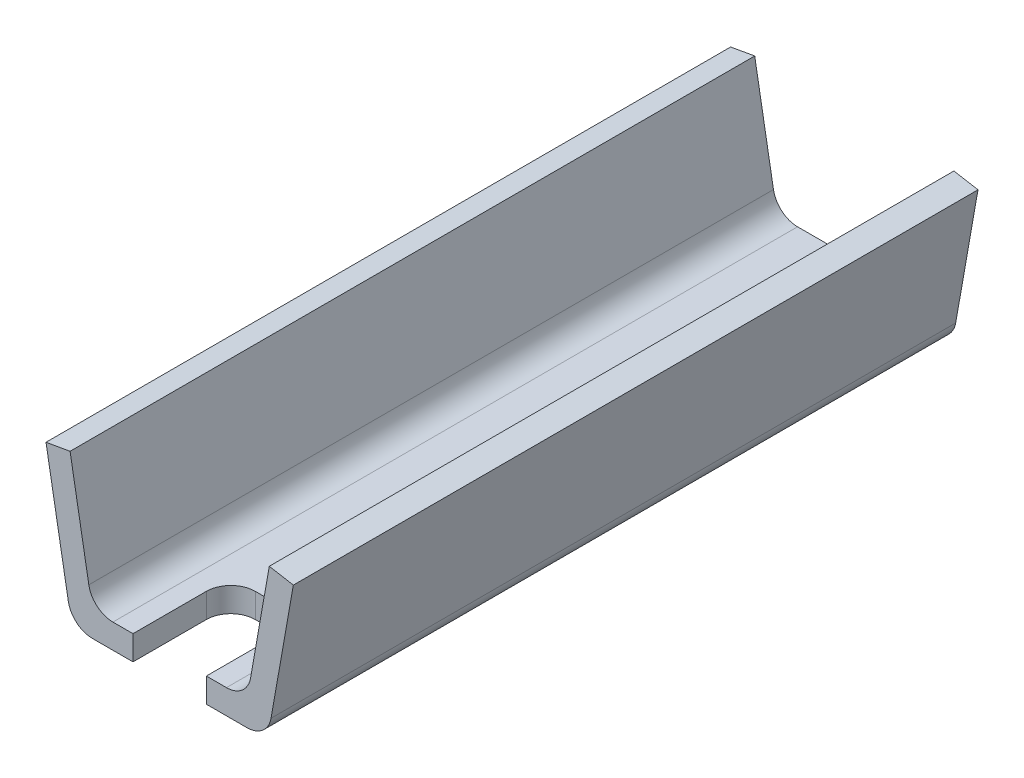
ISO-10303-21;
HEADER;
FILE_DESCRIPTION(('STEP AP214'),'2;1');
FILE_NAME('part.step','',(''),(''),'','','');
FILE_SCHEMA(('AUTOMOTIVE_DESIGN { 1 0 10303 214 1 1 1 1 }'));
ENDSEC;
DATA;
#1=APPLICATION_CONTEXT('core data for automotive mechanical design processes');
#2=APPLICATION_PROTOCOL_DEFINITION('international standard','automotive_design',2000,#1);
#3=PRODUCT_CONTEXT('',#1,'mechanical');
#4=PRODUCT('Part','Part','',(#3));
#5=PRODUCT_RELATED_PRODUCT_CATEGORY('part','',(#4));
#6=PRODUCT_DEFINITION_FORMATION('','',#4);
#7=PRODUCT_DEFINITION_CONTEXT('part definition',#1,'design');
#8=PRODUCT_DEFINITION('design','',#6,#7);
#9=PRODUCT_DEFINITION_SHAPE('','',#8);
#10=(LENGTH_UNIT() NAMED_UNIT(*) SI_UNIT(.MILLI.,.METRE.));
#11=(NAMED_UNIT(*) PLANE_ANGLE_UNIT() SI_UNIT($,.RADIAN.));
#12=(NAMED_UNIT(*) SI_UNIT($,.STERADIAN.) SOLID_ANGLE_UNIT());
#13=UNCERTAINTY_MEASURE_WITH_UNIT(LENGTH_MEASURE(1.E-05),#10,'distance_accuracy_value','');
#14=(GEOMETRIC_REPRESENTATION_CONTEXT(3) GLOBAL_UNCERTAINTY_ASSIGNED_CONTEXT((#13)) GLOBAL_UNIT_ASSIGNED_CONTEXT((#10,
#11,#12)) REPRESENTATION_CONTEXT('',''));
#15=CARTESIAN_POINT('',(0.,0.,0.));
#16=DIRECTION('',(0.,0.,1.));
#17=DIRECTION('',(1.,0.,0.));
#18=AXIS2_PLACEMENT_3D('',#15,#16,#17);
#19=CARTESIAN_POINT('',(11.6090036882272,10.,140.));
#20=DIRECTION('',(0.,0.,-1.));
#21=DIRECTION('',(-1.,0.,0.));
#22=AXIS2_PLACEMENT_3D('',#19,#20,#21);
#23=PLANE('',#22);
#24=DIRECTION('',(1.,0.,0.));
#25=VECTOR('',#24,1.);
#26=CARTESIAN_POINT('',(-15.8045018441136,0.,140.));
#27=LINE('',#26,#25);
#28=CARTESIAN_POINT('',(-15.8045018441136,0.,140.));
#29=VERTEX_POINT('',#28);
#30=CARTESIAN_POINT('',(-7.5,0.,140.));
#31=VERTEX_POINT('',#30);
#32=EDGE_CURVE('E207',#29,#31,#27,.T.);
#33=ORIENTED_EDGE('',*,*,#32,.T.);
#34=DIRECTION('',(0.,1.,0.));
#35=VECTOR('',#34,1.);
#36=CARTESIAN_POINT('',(-7.5,9.99999999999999,140.));
#37=LINE('',#36,#35);
#38=CARTESIAN_POINT('',(-7.5,5.,140.));
#39=VERTEX_POINT('',#38);
#40=EDGE_CURVE('E184',#31,#39,#37,.T.);
#41=ORIENTED_EDGE('',*,*,#40,.T.);
#42=DIRECTION('',(-1.,0.,0.));
#43=VECTOR('',#42,1.);
#44=CARTESIAN_POINT('',(11.6090036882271,5.,140.));
#45=LINE('',#44,#43);
#46=CARTESIAN_POINT('',(-11.6090036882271,5.,140.));
#47=VERTEX_POINT('',#46);
#48=EDGE_CURVE('E192',#39,#47,#45,.T.);
#49=ORIENTED_EDGE('',*,*,#48,.T.);
#50=CARTESIAN_POINT('',(-11.6090036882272,9.99999999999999,140.));
#51=DIRECTION('',(0.,0.,-1.));
#52=DIRECTION('',(-1.,0.,0.));
#53=AXIS2_PLACEMENT_3D('',#50,#51,#52);
#54=CIRCLE('',#53,5.);
#55=CARTESIAN_POINT('',(-16.5330424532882,9.13175911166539,140.));
#56=VERTEX_POINT('',#55);
#57=EDGE_CURVE('E191',#47,#56,#54,.T.);
#58=ORIENTED_EDGE('',*,*,#57,.T.);
#59=DIRECTION('',(-0.173648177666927,0.984807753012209,0.));
#60=VECTOR('',#59,1.);
#61=CARTESIAN_POINT('',(-16.5330424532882,9.13175911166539,140.));
#62=LINE('',#61,#60);
#63=CARTESIAN_POINT('',(-20.3657706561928,30.8682408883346,140.));
#64=VERTEX_POINT('',#63);
#65=EDGE_CURVE('E194',#56,#64,#62,.T.);
#66=ORIENTED_EDGE('',*,*,#65,.T.);
#67=DIRECTION('',(-0.984807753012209,-0.173648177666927,0.));
#68=VECTOR('',#67,1.);
#69=CARTESIAN_POINT('',(-20.3657706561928,30.8682408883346,140.));
#70=LINE('',#69,#68);
#71=CARTESIAN_POINT('',(-25.2898094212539,30.,140.));
#72=VERTEX_POINT('',#71);
#73=EDGE_CURVE('E200',#64,#72,#70,.T.);
#74=ORIENTED_EDGE('',*,*,#73,.T.);
#75=DIRECTION('',(0.173648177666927,-0.984807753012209,0.));
#76=VECTOR('',#75,1.);
#77=CARTESIAN_POINT('',(-25.2898094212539,30.,140.));
#78=LINE('',#77,#76);
#79=CARTESIAN_POINT('',(-20.7285406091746,4.13175911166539,140.));
#80=VERTEX_POINT('',#79);
#81=EDGE_CURVE('E202',#72,#80,#78,.T.);
#82=ORIENTED_EDGE('',*,*,#81,.T.);
#83=CARTESIAN_POINT('',(-15.8045018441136,5.,140.));
#84=DIRECTION('',(0.,0.,1.));
#85=DIRECTION('',(-1.,0.,0.));
#86=AXIS2_PLACEMENT_3D('',#83,#84,#85);
#87=CIRCLE('',#86,5.);
#88=EDGE_CURVE('E204',#80,#29,#87,.T.);
#89=ORIENTED_EDGE('',*,*,#88,.T.);
#90=EDGE_LOOP('',(#33,#41,#49,#58,#66,#74,#82,#89));
#91=FACE_BOUND('',#90,.T.);
#92=ADVANCED_FACE('F41',(#91),#23,.F.);
#93=CARTESIAN_POINT('',(25.2898094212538,30.,140.));
#94=DIRECTION('',(-0.173648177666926,-0.984807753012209,0.));
#95=DIRECTION('',(0.984807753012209,-0.173648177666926,0.));
#96=AXIS2_PLACEMENT_3D('',#93,#94,#95);
#97=PLANE('',#96);
#98=DIRECTION('',(-0.984807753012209,0.173648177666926,0.));
#99=VECTOR('',#98,1.);
#100=CARTESIAN_POINT('',(25.2898094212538,30.,0.));
#101=LINE('',#100,#99);
#102=CARTESIAN_POINT('',(25.2898094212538,30.,0.));
#103=VERTEX_POINT('',#102);
#104=CARTESIAN_POINT('',(20.3657706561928,30.8682408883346,0.));
#105=VERTEX_POINT('',#104);
#106=EDGE_CURVE('E349',#103,#105,#101,.T.);
#107=ORIENTED_EDGE('',*,*,#106,.T.);
#108=DIRECTION('',(0.,0.,-1.));
#109=VECTOR('',#108,1.);
#110=CARTESIAN_POINT('',(20.3657706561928,30.8682408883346,140.));
#111=LINE('',#110,#109);
#112=CARTESIAN_POINT('',(20.3657706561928,30.8682408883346,140.));
#113=VERTEX_POINT('',#112);
#114=EDGE_CURVE('E185',#113,#105,#111,.T.);
#115=ORIENTED_EDGE('',*,*,#114,.F.);
#116=DIRECTION('',(-0.984807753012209,0.173648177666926,0.));
#117=VECTOR('',#116,1.);
#118=CARTESIAN_POINT('',(25.2898094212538,30.,140.));
#119=LINE('',#118,#117);
#120=CARTESIAN_POINT('',(25.2898094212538,30.,140.));
#121=VERTEX_POINT('',#120);
#122=EDGE_CURVE('E374',#121,#113,#119,.T.);
#123=ORIENTED_EDGE('',*,*,#122,.F.);
#124=DIRECTION('',(0.,0.,-1.));
#125=VECTOR('',#124,1.);
#126=CARTESIAN_POINT('',(25.2898094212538,30.,140.));
#127=LINE('',#126,#125);
#128=EDGE_CURVE('E214',#121,#103,#127,.T.);
#129=ORIENTED_EDGE('',*,*,#128,.T.);
#130=EDGE_LOOP('',(#107,#115,#123,#129));
#131=FACE_BOUND('',#130,.T.);
#132=ADVANCED_FACE('F43',(#131),#97,.F.);
#133=CARTESIAN_POINT('',(20.3657706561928,30.8682408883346,140.));
#134=DIRECTION('',(0.984807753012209,-0.173648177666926,0.));
#135=DIRECTION('',(0.173648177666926,0.984807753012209,0.));
#136=AXIS2_PLACEMENT_3D('',#133,#134,#135);
#137=PLANE('',#136);
#138=DIRECTION('',(-0.173648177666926,-0.984807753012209,0.));
#139=VECTOR('',#138,1.);
#140=CARTESIAN_POINT('',(20.3657706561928,30.8682408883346,0.));
#141=LINE('',#140,#139);
#142=CARTESIAN_POINT('',(16.5330424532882,9.1317591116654,0.));
#143=VERTEX_POINT('',#142);
#144=EDGE_CURVE('E343',#105,#143,#141,.T.);
#145=ORIENTED_EDGE('',*,*,#144,.T.);
#146=DIRECTION('',(0.,0.,-1.));
#147=VECTOR('',#146,1.);
#148=CARTESIAN_POINT('',(16.5330424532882,9.1317591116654,140.));
#149=LINE('',#148,#147);
#150=CARTESIAN_POINT('',(16.5330424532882,9.1317591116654,140.));
#151=VERTEX_POINT('',#150);
#152=EDGE_CURVE('E243',#151,#143,#149,.T.);
#153=ORIENTED_EDGE('',*,*,#152,.F.);
#154=DIRECTION('',(-0.173648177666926,-0.984807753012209,0.));
#155=VECTOR('',#154,1.);
#156=CARTESIAN_POINT('',(20.3657706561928,30.8682408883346,140.));
#157=LINE('',#156,#155);
#158=EDGE_CURVE('E376',#113,#151,#157,.T.);
#159=ORIENTED_EDGE('',*,*,#158,.F.);
#160=ORIENTED_EDGE('',*,*,#114,.T.);
#161=EDGE_LOOP('',(#145,#153,#159,#160));
#162=FACE_BOUND('',#161,.T.);
#163=ADVANCED_FACE('F293',(#162),#137,.F.);
#164=CARTESIAN_POINT('',(11.6090036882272,10.,140.));
#165=DIRECTION('',(0.,0.,-1.));
#166=DIRECTION('',(-1.,0.,0.));
#167=AXIS2_PLACEMENT_3D('',#164,#165,#166);
#168=CYLINDRICAL_SURFACE('',#167,5.);
#169=CARTESIAN_POINT('',(11.6090036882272,10.,0.));
#170=DIRECTION('',(0.,0.,-1.));
#171=DIRECTION('',(-1.,0.,0.));
#172=AXIS2_PLACEMENT_3D('',#169,#170,#171);
#173=CIRCLE('',#172,5.);
#174=CARTESIAN_POINT('',(11.6090036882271,5.,0.));
#175=VERTEX_POINT('',#174);
#176=EDGE_CURVE('E348',#143,#175,#173,.T.);
#177=ORIENTED_EDGE('',*,*,#176,.T.);
#178=DIRECTION('',(0.,0.,-1.));
#179=VECTOR('',#178,1.);
#180=CARTESIAN_POINT('',(11.6090036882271,5.,140.));
#181=LINE('',#180,#179);
#182=CARTESIAN_POINT('',(11.6090036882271,5.,140.));
#183=VERTEX_POINT('',#182);
#184=EDGE_CURVE('E241',#183,#175,#181,.T.);
#185=ORIENTED_EDGE('',*,*,#184,.F.);
#186=CARTESIAN_POINT('',(11.6090036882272,10.,140.));
#187=DIRECTION('',(0.,0.,-1.));
#188=DIRECTION('',(-1.,0.,0.));
#189=AXIS2_PLACEMENT_3D('',#186,#187,#188);
#190=CIRCLE('',#189,5.);
#191=EDGE_CURVE('E189',#151,#183,#190,.T.);
#192=ORIENTED_EDGE('',*,*,#191,.F.);
#193=ORIENTED_EDGE('',*,*,#152,.T.);
#194=EDGE_LOOP('',(#177,#185,#192,#193));
#195=FACE_BOUND('',#194,.T.);
#196=ADVANCED_FACE('F335',(#195),#168,.F.);
#197=CARTESIAN_POINT('',(11.6090036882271,5.,140.));
#198=DIRECTION('',(0.,-1.,0.));
#199=DIRECTION('',(1.,0.,0.));
#200=AXIS2_PLACEMENT_3D('',#197,#198,#199);
#201=PLANE('',#200);
#202=ORIENTED_EDGE('',*,*,#48,.F.);
#203=DIRECTION('',(0.,0.,-1.));
#204=VECTOR('',#203,1.);
#205=CARTESIAN_POINT('',(-7.5,5.,140.));
#206=LINE('',#205,#204);
#207=CARTESIAN_POINT('',(-7.5,5.,125.));
#208=VERTEX_POINT('',#207);
#209=EDGE_CURVE('E382',#39,#208,#206,.T.);
#210=ORIENTED_EDGE('',*,*,#209,.T.);
#211=CARTESIAN_POINT('',(-2.5,5.,125.));
#212=DIRECTION('',(0.,-1.,0.));
#213=DIRECTION('',(1.,0.,0.));
#214=AXIS2_PLACEMENT_3D('',#211,#212,#213);
#215=CIRCLE('',#214,5.);
#216=CARTESIAN_POINT('',(-2.5,5.,120.));
#217=VERTEX_POINT('',#216);
#218=EDGE_CURVE('E11',#208,#217,#215,.T.);
#219=ORIENTED_EDGE('',*,*,#218,.T.);
#220=DIRECTION('',(-1.,0.,0.));
#221=VECTOR('',#220,1.);
#222=CARTESIAN_POINT('',(11.6090036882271,5.,120.));
#223=LINE('',#222,#221);
#224=CARTESIAN_POINT('',(2.5,5.,120.));
#225=VERTEX_POINT('',#224);
#226=EDGE_CURVE('E381',#225,#217,#223,.T.);
#227=ORIENTED_EDGE('',*,*,#226,.F.);
#228=CARTESIAN_POINT('',(2.5,5.,125.));
#229=DIRECTION('',(0.,-1.,0.));
#230=DIRECTION('',(1.,0.,0.));
#231=AXIS2_PLACEMENT_3D('',#228,#229,#230);
#232=CIRCLE('',#231,5.);
#233=CARTESIAN_POINT('',(7.5,5.,125.));
#234=VERTEX_POINT('',#233);
#235=EDGE_CURVE('E172',#225,#234,#232,.T.);
#236=ORIENTED_EDGE('',*,*,#235,.T.);
#237=DIRECTION('',(0.,0.,1.));
#238=VECTOR('',#237,1.);
#239=CARTESIAN_POINT('',(7.5,5.,140.));
#240=LINE('',#239,#238);
#241=CARTESIAN_POINT('',(7.5,5.,140.));
#242=VERTEX_POINT('',#241);
#243=EDGE_CURVE('E164',#234,#242,#240,.T.);
#244=ORIENTED_EDGE('',*,*,#243,.T.);
#245=EDGE_CURVE('E170',#183,#242,#45,.T.);
#246=ORIENTED_EDGE('',*,*,#245,.F.);
#247=ORIENTED_EDGE('',*,*,#184,.T.);
#248=DIRECTION('',(-1.,0.,0.));
#249=VECTOR('',#248,1.);
#250=CARTESIAN_POINT('',(11.6090036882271,5.,0.));
#251=LINE('',#250,#249);
#252=CARTESIAN_POINT('',(-11.6090036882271,5.,0.));
#253=VERTEX_POINT('',#252);
#254=EDGE_CURVE('E353',#175,#253,#251,.T.);
#255=ORIENTED_EDGE('',*,*,#254,.T.);
#256=DIRECTION('',(0.,0.,-1.));
#257=VECTOR('',#256,1.);
#258=CARTESIAN_POINT('',(-11.6090036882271,5.,140.));
#259=LINE('',#258,#257);
#260=EDGE_CURVE('E238',#47,#253,#259,.T.);
#261=ORIENTED_EDGE('',*,*,#260,.F.);
#262=EDGE_LOOP('',(#202,#210,#219,#227,#236,#244,#246,#247,#255,#261));
#263=FACE_BOUND('',#262,.T.);
#264=ADVANCED_FACE('F167',(#263),#201,.F.);
#265=CARTESIAN_POINT('',(-11.6090036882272,9.99999999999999,140.));
#266=DIRECTION('',(0.,0.,-1.));
#267=DIRECTION('',(-1.,0.,0.));
#268=AXIS2_PLACEMENT_3D('',#265,#266,#267);
#269=CYLINDRICAL_SURFACE('',#268,5.);
#270=CARTESIAN_POINT('',(-11.6090036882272,9.99999999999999,0.));
#271=DIRECTION('',(0.,0.,-1.));
#272=DIRECTION('',(-1.,0.,0.));
#273=AXIS2_PLACEMENT_3D('',#270,#271,#272);
#274=CIRCLE('',#273,5.);
#275=CARTESIAN_POINT('',(-16.5330424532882,9.13175911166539,0.));
#276=VERTEX_POINT('',#275);
#277=EDGE_CURVE('E355',#253,#276,#274,.T.);
#278=ORIENTED_EDGE('',*,*,#277,.T.);
#279=DIRECTION('',(0.,0.,-1.));
#280=VECTOR('',#279,1.);
#281=CARTESIAN_POINT('',(-16.5330424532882,9.13175911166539,140.));
#282=LINE('',#281,#280);
#283=EDGE_CURVE('E235',#56,#276,#282,.T.);
#284=ORIENTED_EDGE('',*,*,#283,.F.);
#285=ORIENTED_EDGE('',*,*,#57,.F.);
#286=ORIENTED_EDGE('',*,*,#260,.T.);
#287=EDGE_LOOP('',(#278,#284,#285,#286));
#288=FACE_BOUND('',#287,.T.);
#289=ADVANCED_FACE('F329',(#288),#269,.F.);
#290=CARTESIAN_POINT('',(-16.5330424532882,9.13175911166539,140.));
#291=DIRECTION('',(-0.984807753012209,-0.173648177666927,0.));
#292=DIRECTION('',(0.173648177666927,-0.984807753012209,0.));
#293=AXIS2_PLACEMENT_3D('',#290,#291,#292);
#294=PLANE('',#293);
#295=DIRECTION('',(-0.173648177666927,0.984807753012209,0.));
#296=VECTOR('',#295,1.);
#297=CARTESIAN_POINT('',(-16.5330424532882,9.13175911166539,0.));
#298=LINE('',#297,#296);
#299=CARTESIAN_POINT('',(-20.3657706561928,30.8682408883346,0.));
#300=VERTEX_POINT('',#299);
#301=EDGE_CURVE('E360',#276,#300,#298,.T.);
#302=ORIENTED_EDGE('',*,*,#301,.T.);
#303=DIRECTION('',(0.,0.,-1.));
#304=VECTOR('',#303,1.);
#305=CARTESIAN_POINT('',(-20.3657706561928,30.8682408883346,140.));
#306=LINE('',#305,#304);
#307=EDGE_CURVE('E232',#64,#300,#306,.T.);
#308=ORIENTED_EDGE('',*,*,#307,.F.);
#309=ORIENTED_EDGE('',*,*,#65,.F.);
#310=ORIENTED_EDGE('',*,*,#283,.T.);
#311=EDGE_LOOP('',(#302,#308,#309,#310));
#312=FACE_BOUND('',#311,.T.);
#313=ADVANCED_FACE('F325',(#312),#294,.F.);
#314=CARTESIAN_POINT('',(-20.3657706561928,30.8682408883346,140.));
#315=DIRECTION('',(0.173648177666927,-0.984807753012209,0.));
#316=DIRECTION('',(0.984807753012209,0.173648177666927,0.));
#317=AXIS2_PLACEMENT_3D('',#314,#315,#316);
#318=PLANE('',#317);
#319=DIRECTION('',(-0.984807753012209,-0.173648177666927,0.));
#320=VECTOR('',#319,1.);
#321=CARTESIAN_POINT('',(-20.3657706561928,30.8682408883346,0.));
#322=LINE('',#321,#320);
#323=CARTESIAN_POINT('',(-25.2898094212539,30.,0.));
#324=VERTEX_POINT('',#323);
#325=EDGE_CURVE('E362',#300,#324,#322,.T.);
#326=ORIENTED_EDGE('',*,*,#325,.T.);
#327=DIRECTION('',(0.,0.,-1.));
#328=VECTOR('',#327,1.);
#329=CARTESIAN_POINT('',(-25.2898094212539,30.,140.));
#330=LINE('',#329,#328);
#331=EDGE_CURVE('E229',#72,#324,#330,.T.);
#332=ORIENTED_EDGE('',*,*,#331,.F.);
#333=ORIENTED_EDGE('',*,*,#73,.F.);
#334=ORIENTED_EDGE('',*,*,#307,.T.);
#335=EDGE_LOOP('',(#326,#332,#333,#334));
#336=FACE_BOUND('',#335,.T.);
#337=ADVANCED_FACE('F321',(#336),#318,.F.);
#338=CARTESIAN_POINT('',(-25.2898094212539,30.,140.));
#339=DIRECTION('',(0.984807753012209,0.173648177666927,0.));
#340=DIRECTION('',(-0.173648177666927,0.984807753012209,0.));
#341=AXIS2_PLACEMENT_3D('',#338,#339,#340);
#342=PLANE('',#341);
#343=DIRECTION('',(0.173648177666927,-0.984807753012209,0.));
#344=VECTOR('',#343,1.);
#345=CARTESIAN_POINT('',(-25.2898094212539,30.,0.));
#346=LINE('',#345,#344);
#347=CARTESIAN_POINT('',(-20.7285406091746,4.13175911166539,0.));
#348=VERTEX_POINT('',#347);
#349=EDGE_CURVE('E364',#324,#348,#346,.T.);
#350=ORIENTED_EDGE('',*,*,#349,.T.);
#351=DIRECTION('',(0.,0.,-1.));
#352=VECTOR('',#351,1.);
#353=CARTESIAN_POINT('',(-20.7285406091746,4.13175911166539,140.));
#354=LINE('',#353,#352);
#355=EDGE_CURVE('E226',#80,#348,#354,.T.);
#356=ORIENTED_EDGE('',*,*,#355,.F.);
#357=ORIENTED_EDGE('',*,*,#81,.F.);
#358=ORIENTED_EDGE('',*,*,#331,.T.);
#359=EDGE_LOOP('',(#350,#356,#357,#358));
#360=FACE_BOUND('',#359,.T.);
#361=ADVANCED_FACE('F317',(#360),#342,.F.);
#362=CARTESIAN_POINT('',(-15.8045018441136,5.,140.));
#363=DIRECTION('',(0.,0.,-1.));
#364=DIRECTION('',(-1.,0.,0.));
#365=AXIS2_PLACEMENT_3D('',#362,#363,#364);
#366=CYLINDRICAL_SURFACE('',#365,5.);
#367=CARTESIAN_POINT('',(-15.8045018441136,5.,0.));
#368=DIRECTION('',(0.,0.,1.));
#369=DIRECTION('',(-1.,0.,0.));
#370=AXIS2_PLACEMENT_3D('',#367,#368,#369);
#371=CIRCLE('',#370,5.);
#372=CARTESIAN_POINT('',(-15.8045018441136,0.,0.));
#373=VERTEX_POINT('',#372);
#374=EDGE_CURVE('E366',#348,#373,#371,.T.);
#375=ORIENTED_EDGE('',*,*,#374,.T.);
#376=DIRECTION('',(0.,0.,-1.));
#377=VECTOR('',#376,1.);
#378=CARTESIAN_POINT('',(-15.8045018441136,0.,140.));
#379=LINE('',#378,#377);
#380=EDGE_CURVE('E223',#29,#373,#379,.T.);
#381=ORIENTED_EDGE('',*,*,#380,.F.);
#382=ORIENTED_EDGE('',*,*,#88,.F.);
#383=ORIENTED_EDGE('',*,*,#355,.T.);
#384=EDGE_LOOP('',(#375,#381,#382,#383));
#385=FACE_BOUND('',#384,.T.);
#386=ADVANCED_FACE('F314',(#385),#366,.T.);
#387=CARTESIAN_POINT('',(-15.8045018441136,0.,140.));
#388=DIRECTION('',(0.,1.,0.));
#389=DIRECTION('',(0.,0.,1.));
#390=AXIS2_PLACEMENT_3D('',#387,#388,#389);
#391=PLANE('',#390);
#392=DIRECTION('',(1.,0.,0.));
#393=VECTOR('',#392,1.);
#394=CARTESIAN_POINT('',(-15.8045018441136,0.,120.));
#395=LINE('',#394,#393);
#396=CARTESIAN_POINT('',(-2.5,0.,120.));
#397=VERTEX_POINT('',#396);
#398=CARTESIAN_POINT('',(2.5,0.,120.));
#399=VERTEX_POINT('',#398);
#400=EDGE_CURVE('E250',#397,#399,#395,.T.);
#401=ORIENTED_EDGE('',*,*,#400,.F.);
#402=CARTESIAN_POINT('',(-2.5,0.,125.));
#403=DIRECTION('',(0.,1.,0.));
#404=DIRECTION('',(0.,0.,1.));
#405=AXIS2_PLACEMENT_3D('',#402,#403,#404);
#406=CIRCLE('',#405,5.);
#407=CARTESIAN_POINT('',(-7.5,0.,125.));
#408=VERTEX_POINT('',#407);
#409=EDGE_CURVE('E49',#397,#408,#406,.T.);
#410=ORIENTED_EDGE('',*,*,#409,.T.);
#411=DIRECTION('',(0.,0.,1.));
#412=VECTOR('',#411,1.);
#413=CARTESIAN_POINT('',(-7.5,0.,140.));
#414=LINE('',#413,#412);
#415=EDGE_CURVE('E175',#408,#31,#414,.T.);
#416=ORIENTED_EDGE('',*,*,#415,.T.);
#417=ORIENTED_EDGE('',*,*,#32,.F.);
#418=ORIENTED_EDGE('',*,*,#380,.T.);
#419=DIRECTION('',(1.,0.,0.));
#420=VECTOR('',#419,1.);
#421=CARTESIAN_POINT('',(-15.8045018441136,0.,0.));
#422=LINE('',#421,#420);
#423=CARTESIAN_POINT('',(15.8045018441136,0.,0.));
#424=VERTEX_POINT('',#423);
#425=EDGE_CURVE('E368',#373,#424,#422,.T.);
#426=ORIENTED_EDGE('',*,*,#425,.T.);
#427=DIRECTION('',(0.,0.,-1.));
#428=VECTOR('',#427,1.);
#429=CARTESIAN_POINT('',(15.8045018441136,0.,140.));
#430=LINE('',#429,#428);
#431=CARTESIAN_POINT('',(15.8045018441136,0.,140.));
#432=VERTEX_POINT('',#431);
#433=EDGE_CURVE('E220',#432,#424,#430,.T.);
#434=ORIENTED_EDGE('',*,*,#433,.F.);
#435=CARTESIAN_POINT('',(7.5,0.,140.));
#436=VERTEX_POINT('',#435);
#437=EDGE_CURVE('E206',#436,#432,#27,.T.);
#438=ORIENTED_EDGE('',*,*,#437,.F.);
#439=DIRECTION('',(0.,0.,-1.));
#440=VECTOR('',#439,1.);
#441=CARTESIAN_POINT('',(7.5,0.,140.));
#442=LINE('',#441,#440);
#443=CARTESIAN_POINT('',(7.5,0.,125.));
#444=VERTEX_POINT('',#443);
#445=EDGE_CURVE('E176',#436,#444,#442,.T.);
#446=ORIENTED_EDGE('',*,*,#445,.T.);
#447=CARTESIAN_POINT('',(2.5,0.,125.));
#448=DIRECTION('',(0.,1.,0.));
#449=DIRECTION('',(0.,0.,1.));
#450=AXIS2_PLACEMENT_3D('',#447,#448,#449);
#451=CIRCLE('',#450,5.);
#452=EDGE_CURVE('E263',#444,#399,#451,.T.);
#453=ORIENTED_EDGE('',*,*,#452,.T.);
#454=EDGE_LOOP('',(#401,#410,#416,#417,#418,#426,#434,#438,#446,#453));
#455=FACE_BOUND('',#454,.T.);
#456=ADVANCED_FACE('F265',(#455),#391,.F.);
#457=CARTESIAN_POINT('',(15.8045018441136,5.,140.));
#458=DIRECTION('',(0.,0.,-1.));
#459=DIRECTION('',(-1.,0.,0.));
#460=AXIS2_PLACEMENT_3D('',#457,#458,#459);
#461=CYLINDRICAL_SURFACE('',#460,5.);
#462=CARTESIAN_POINT('',(15.8045018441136,5.,0.));
#463=DIRECTION('',(0.,0.,1.));
#464=DIRECTION('',(1.,0.,0.));
#465=AXIS2_PLACEMENT_3D('',#462,#463,#464);
#466=CIRCLE('',#465,5.);
#467=CARTESIAN_POINT('',(20.7285406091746,4.1317591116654,0.));
#468=VERTEX_POINT('',#467);
#469=EDGE_CURVE('E370',#424,#468,#466,.T.);
#470=ORIENTED_EDGE('',*,*,#469,.T.);
#471=DIRECTION('',(0.,0.,-1.));
#472=VECTOR('',#471,1.);
#473=CARTESIAN_POINT('',(20.7285406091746,4.1317591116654,140.));
#474=LINE('',#473,#472);
#475=CARTESIAN_POINT('',(20.7285406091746,4.1317591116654,140.));
#476=VERTEX_POINT('',#475);
#477=EDGE_CURVE('E217',#476,#468,#474,.T.);
#478=ORIENTED_EDGE('',*,*,#477,.F.);
#479=CARTESIAN_POINT('',(15.8045018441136,5.,140.));
#480=DIRECTION('',(0.,0.,1.));
#481=DIRECTION('',(1.,0.,0.));
#482=AXIS2_PLACEMENT_3D('',#479,#480,#481);
#483=CIRCLE('',#482,5.);
#484=EDGE_CURVE('E210',#432,#476,#483,.T.);
#485=ORIENTED_EDGE('',*,*,#484,.F.);
#486=ORIENTED_EDGE('',*,*,#433,.T.);
#487=EDGE_LOOP('',(#470,#478,#485,#486));
#488=FACE_BOUND('',#487,.T.);
#489=ADVANCED_FACE('F304',(#488),#461,.T.);
#490=CARTESIAN_POINT('',(20.7285406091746,4.1317591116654,140.));
#491=DIRECTION('',(-0.984807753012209,0.173648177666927,0.));
#492=DIRECTION('',(-0.173648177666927,-0.984807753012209,0.));
#493=AXIS2_PLACEMENT_3D('',#490,#491,#492);
#494=PLANE('',#493);
#495=DIRECTION('',(0.173648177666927,0.984807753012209,0.));
#496=VECTOR('',#495,1.);
#497=CARTESIAN_POINT('',(20.7285406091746,4.1317591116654,0.));
#498=LINE('',#497,#496);
#499=EDGE_CURVE('E372',#468,#103,#498,.T.);
#500=ORIENTED_EDGE('',*,*,#499,.T.);
#501=ORIENTED_EDGE('',*,*,#128,.F.);
#502=DIRECTION('',(0.173648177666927,0.984807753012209,0.));
#503=VECTOR('',#502,1.);
#504=CARTESIAN_POINT('',(20.7285406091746,4.1317591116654,140.));
#505=LINE('',#504,#503);
#506=EDGE_CURVE('E212',#476,#121,#505,.T.);
#507=ORIENTED_EDGE('',*,*,#506,.F.);
#508=ORIENTED_EDGE('',*,*,#477,.T.);
#509=EDGE_LOOP('',(#500,#501,#507,#508));
#510=FACE_BOUND('',#509,.T.);
#511=ADVANCED_FACE('F298',(#510),#494,.F.);
#512=ORIENTED_EDGE('',*,*,#245,.T.);
#513=DIRECTION('',(0.,-1.,0.));
#514=VECTOR('',#513,1.);
#515=CARTESIAN_POINT('',(7.5,10.,140.));
#516=LINE('',#515,#514);
#517=EDGE_CURVE('E179',#242,#436,#516,.T.);
#518=ORIENTED_EDGE('',*,*,#517,.T.);
#519=ORIENTED_EDGE('',*,*,#437,.T.);
#520=ORIENTED_EDGE('',*,*,#484,.T.);
#521=ORIENTED_EDGE('',*,*,#506,.T.);
#522=ORIENTED_EDGE('',*,*,#122,.T.);
#523=ORIENTED_EDGE('',*,*,#158,.T.);
#524=ORIENTED_EDGE('',*,*,#191,.T.);
#525=EDGE_LOOP('',(#512,#518,#519,#520,#521,#522,#523,#524));
#526=FACE_BOUND('',#525,.T.);
#527=ADVANCED_FACE('F187',(#526),#23,.F.);
#528=CARTESIAN_POINT('',(11.6090036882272,10.,0.));
#529=DIRECTION('',(0.,0.,-1.));
#530=DIRECTION('',(-1.,0.,0.));
#531=AXIS2_PLACEMENT_3D('',#528,#529,#530);
#532=PLANE('',#531);
#533=ORIENTED_EDGE('',*,*,#106,.F.);
#534=ORIENTED_EDGE('',*,*,#499,.F.);
#535=ORIENTED_EDGE('',*,*,#469,.F.);
#536=ORIENTED_EDGE('',*,*,#425,.F.);
#537=ORIENTED_EDGE('',*,*,#374,.F.);
#538=ORIENTED_EDGE('',*,*,#349,.F.);
#539=ORIENTED_EDGE('',*,*,#325,.F.);
#540=ORIENTED_EDGE('',*,*,#301,.F.);
#541=ORIENTED_EDGE('',*,*,#277,.F.);
#542=ORIENTED_EDGE('',*,*,#254,.F.);
#543=ORIENTED_EDGE('',*,*,#176,.F.);
#544=ORIENTED_EDGE('',*,*,#144,.F.);
#545=EDGE_LOOP('',(#533,#534,#535,#536,#537,#538,#539,#540,#541,#542,#543,#544));
#546=FACE_BOUND('',#545,.T.);
#547=ADVANCED_FACE('F297',(#546),#532,.T.);
#548=CARTESIAN_POINT('',(-7.5,7.38305751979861,120.));
#549=DIRECTION('',(0.,0.,1.));
#550=DIRECTION('',(1.,0.,0.));
#551=AXIS2_PLACEMENT_3D('',#548,#549,#550);
#552=PLANE('',#551);
#553=ORIENTED_EDGE('',*,*,#400,.T.);
#554=DIRECTION('',(0.,1.,0.));
#555=VECTOR('',#554,1.);
#556=CARTESIAN_POINT('',(2.5,7.38305751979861,120.));
#557=LINE('',#556,#555);
#558=EDGE_CURVE('E256',#399,#225,#557,.T.);
#559=ORIENTED_EDGE('',*,*,#558,.T.);
#560=ORIENTED_EDGE('',*,*,#226,.T.);
#561=DIRECTION('',(0.,-1.,0.));
#562=VECTOR('',#561,1.);
#563=CARTESIAN_POINT('',(-2.5,7.38305751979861,120.));
#564=LINE('',#563,#562);
#565=EDGE_CURVE('E253',#217,#397,#564,.T.);
#566=ORIENTED_EDGE('',*,*,#565,.T.);
#567=EDGE_LOOP('',(#553,#559,#560,#566));
#568=FACE_BOUND('',#567,.T.);
#569=ADVANCED_FACE('F269',(#568),#552,.T.);
#570=CARTESIAN_POINT('',(-7.5,7.38305751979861,120.));
#571=DIRECTION('',(-1.,0.,0.));
#572=DIRECTION('',(0.,-1.,0.));
#573=AXIS2_PLACEMENT_3D('',#570,#571,#572);
#574=PLANE('',#573);
#575=ORIENTED_EDGE('',*,*,#415,.F.);
#576=DIRECTION('',(0.,-1.,0.));
#577=VECTOR('',#576,1.);
#578=CARTESIAN_POINT('',(-7.5,7.38305751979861,125.));
#579=LINE('',#578,#577);
#580=EDGE_CURVE('E56',#408,#208,#579,.F.);
#581=ORIENTED_EDGE('',*,*,#580,.T.);
#582=ORIENTED_EDGE('',*,*,#209,.F.);
#583=ORIENTED_EDGE('',*,*,#40,.F.);
#584=EDGE_LOOP('',(#575,#581,#582,#583));
#585=FACE_BOUND('',#584,.T.);
#586=ADVANCED_FACE('F282',(#585),#574,.F.);
#587=CARTESIAN_POINT('',(7.5,7.38305751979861,120.));
#588=DIRECTION('',(1.,0.,0.));
#589=DIRECTION('',(0.,1.,0.));
#590=AXIS2_PLACEMENT_3D('',#587,#588,#589);
#591=PLANE('',#590);
#592=ORIENTED_EDGE('',*,*,#243,.F.);
#593=DIRECTION('',(0.,1.,0.));
#594=VECTOR('',#593,1.);
#595=CARTESIAN_POINT('',(7.5,7.38305751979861,125.));
#596=LINE('',#595,#594);
#597=EDGE_CURVE('E259',#234,#444,#596,.F.);
#598=ORIENTED_EDGE('',*,*,#597,.T.);
#599=ORIENTED_EDGE('',*,*,#445,.F.);
#600=ORIENTED_EDGE('',*,*,#517,.F.);
#601=EDGE_LOOP('',(#592,#598,#599,#600));
#602=FACE_BOUND('',#601,.T.);
#603=ADVANCED_FACE('F180',(#602),#591,.F.);
#604=CARTESIAN_POINT('',(2.5,7.38305751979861,125.));
#605=DIRECTION('',(0.,1.,0.));
#606=DIRECTION('',(-1.,0.,0.));
#607=AXIS2_PLACEMENT_3D('',#604,#605,#606);
#608=CYLINDRICAL_SURFACE('',#607,5.);
#609=ORIENTED_EDGE('',*,*,#452,.F.);
#610=ORIENTED_EDGE('',*,*,#597,.F.);
#611=ORIENTED_EDGE('',*,*,#235,.F.);
#612=ORIENTED_EDGE('',*,*,#558,.F.);
#613=EDGE_LOOP('',(#609,#610,#611,#612));
#614=FACE_BOUND('',#613,.T.);
#615=ADVANCED_FACE('F272',(#614),#608,.F.);
#616=CARTESIAN_POINT('',(-2.5,7.38305751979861,125.));
#617=DIRECTION('',(0.,-1.,0.));
#618=DIRECTION('',(1.,0.,0.));
#619=AXIS2_PLACEMENT_3D('',#616,#617,#618);
#620=CYLINDRICAL_SURFACE('',#619,5.);
#621=ORIENTED_EDGE('',*,*,#218,.F.);
#622=ORIENTED_EDGE('',*,*,#580,.F.);
#623=ORIENTED_EDGE('',*,*,#409,.F.);
#624=ORIENTED_EDGE('',*,*,#565,.F.);
#625=EDGE_LOOP('',(#621,#622,#623,#624));
#626=FACE_BOUND('',#625,.T.);
#627=ADVANCED_FACE('F274',(#626),#620,.F.);
#628=CLOSED_SHELL('',(#92,#132,#163,#196,#264,#289,#313,#337,#361,#386,#456,#489,#511,#527,#547,
#569,#586,#603,#615,#627));
#629=MANIFOLD_SOLID_BREP('B2',#628);
#630=ADVANCED_BREP_SHAPE_REPRESENTATION('',(#18,#629),#14);
#631=SHAPE_DEFINITION_REPRESENTATION(#9,#630);
ENDSEC;
END-ISO-10303-21;
